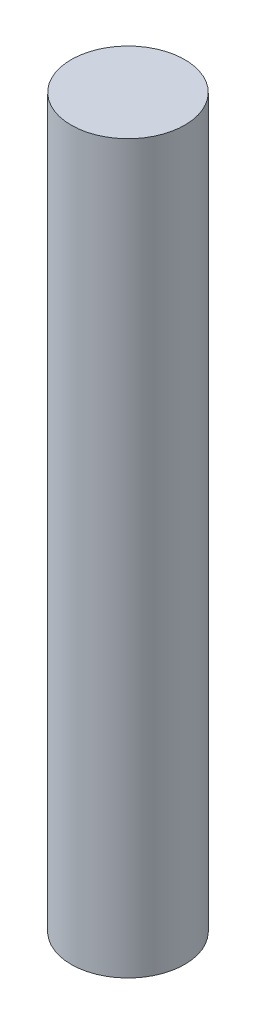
from build123d import *

# Parameters (mm, degrees)
CROQUIS1_R              = 0.5
SALIENTE_EXTRUIR1_DEPTH = 6.4


with BuildPart() as part:
    # Croquis1 → Saliente-Extruir1 (new body)
    with BuildSketch(Plane(origin=(0, 0, 0), x_dir=(1, 0, 0), z_dir=(0, 1, 0))):
        with Locations(Location((0, 0, 0), (0, 0, 270))):
            Circle(CROQUIS1_R)
    extrude(amount=SALIENTE_EXTRUIR1_DEPTH)


solid = part.part
